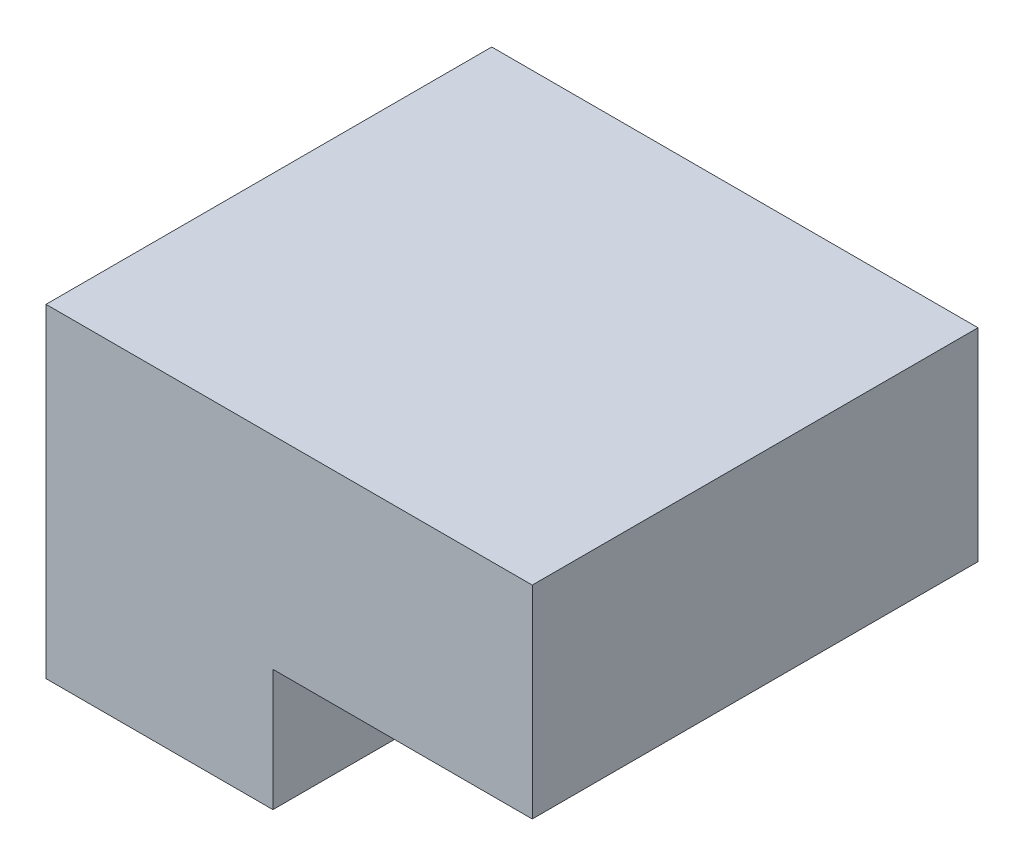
from build123d import *

# Parameters (mm, degrees)
SKETCH_1_W          = 60
SKETCH_1_H          = 40
EXTRUDE_1_DEPTH     = 55
CUT_EXTRUDE_1_DEPTH = 15


with BuildPart() as part:
    # Sketch 1 → Extrude 1 (new body)
    with BuildSketch(Plane.XY):
        with Locations((-30, 20)):
            Rectangle(SKETCH_1_W, SKETCH_1_H)
    extrude(amount=EXTRUDE_1_DEPTH)

    # Sketch 2 → Cut-Extrude 1 (cut)
    with BuildSketch(Plane.XZ):
        Polygon((-32, 55), (0, 55), (0, 0), (-60, 0), (-60, 33), (-32, 33), align=None)
    extrude(amount=-CUT_EXTRUDE_1_DEPTH, mode=Mode.SUBTRACT)


solid = part.part
